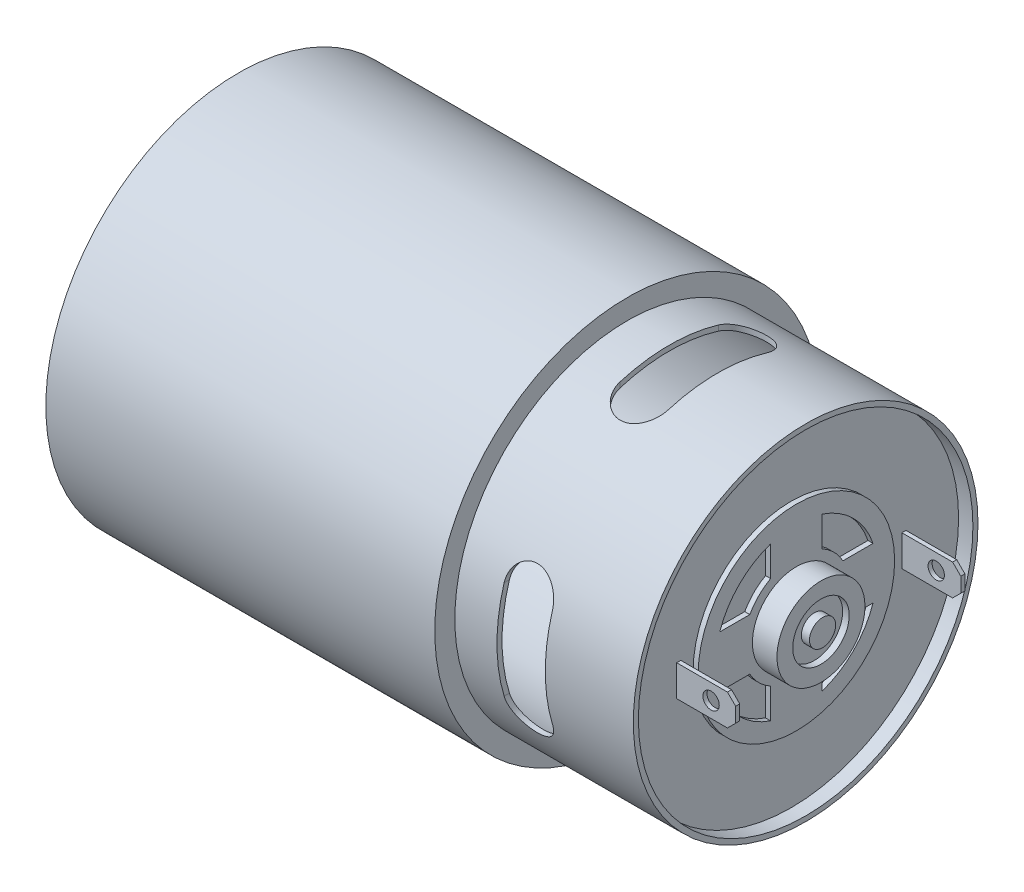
from build123d import *

# Parameters (mm, degrees)
EXTRUDE1_DEPTH           = 92.703985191
CIRPATTERN1_COUNT        = 4
EXTRUDE2_REACH           = 82.546
CIRPATTERN2_COUNT        = 4
EXTRUDE3_REACH           = 82.546
SKETCH4_R                = 1.25
EXTRUDE4_START           = -0.62
EXTRUDE4_DEPTH           = 0.62
CIRPATTERN3_COUNT        = 4
SKETCH6_W                = 7.2
SKETCH6_H                = 3.8
EXTRUDE7_DEPTH           = 0.5
EXTRUDE9_REACH           = 98.248
SKETCH7_R                = 1
CHAMFER1_SIZE            = 1
CHAMFER1_OF_MIRROR1_SIZE = 1
FILLET1_R                = 0.5


with BuildPart() as part:
    # Sketch1 → Revolve1 (revolve)
    with BuildSketch(Plane.XY, mode=Mode.PRIVATE) as revolve1_sk:
        with BuildLine():
            Line((-77.87, 6.5), (-77.87, 2.5))
            Line((-77.87, 2.5), (-82.97, 2.5))
            ThreePointArc((-82.97, 2.5), (-84.737766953, 1.767766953), (-85.47, 0))
            Line((-85.47, 0), (-72.75, 0))
            Line((-72.75, 0), (-72.75, 19.05))
            ThreePointArc((-72.75, 19.05), (-72.345807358, 20.025807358), (-71.37, 20.43))
            Line((-71.37, 20.43), (-4.44, 20.43))
            Line((-4.44, 20.43), (-4.44, 0))
            Line((-4.44, 0), (0, 0))
            Line((0, 0), (0, 1.6))
            Line((0, 1.6), (-1, 1.6))
            Line((-1, 1.6), (-1, 3.45))
            Line((-1, 3.45), (-0.2, 3.45))
            Line((-0.2, 3.45), (-0.2, 5.375))
            Line((-0.2, 5.375), (-3.2, 5.375))
            Line((-3.2, 5.375), (-3.2, 12))
            Line((-3.2, 12), (-3.82, 12))
            Line((-3.82, 12), (-3.82, 20.43))
            Line((-3.82, 20.43), (-2.07, 20.43))
            Line((-2.07, 20.43), (-2.07, 21.05))
            Line((-2.07, 21.05), (-23.87, 21.05))
            Line((-23.87, 21.05), (-23.87, 23.5))
            Line((-23.87, 23.5), (-71.37, 23.5))
            Line((-71.37, 23.5), (-71.37, 21.05))
            ThreePointArc((-71.37, 21.05), (-72.784213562, 20.464213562), (-73.37, 19.05))
            Line((-73.37, 19.05), (-73.37, 6.5))
            Line((-73.37, 6.5), (-77.87, 6.5))
        make_face()
    revolve(revolve1_sk.sketch.rotate(Axis((0, 0, 0), (-1, 0, 0)), 90), axis=Axis((0, 0, 0), (-1, 0, 0)))

    # Sketch2 → Extrude1 (cut, symmetric)
    with BuildSketch(Plane.XY):
        with BuildLine():
            Line((-18.72, 6), (-18.72, -6))
            ThreePointArc((-18.72, -6), (-15.77, -8.95), (-12.82, -6))
            Line((-12.82, -6), (-12.82, 6))
            ThreePointArc((-12.82, 6), (-15.77, 8.95), (-18.72, 6))
        make_face()
    extrude1 = extrude(amount=EXTRUDE1_DEPTH, both=True, mode=Mode.SUBTRACT)

    # CirPattern1: Extrude1 ×4 about axis
    cirpattern1_axis = Axis((0, 0, 0), (1, 0, 0))
    for i in range(1, CIRPATTERN1_COUNT):
        add(extrude1.rotate(cirpattern1_axis, i * 360 / CIRPATTERN1_COUNT), mode=Mode.SUBTRACT)

    # Sketch3 → Extrude2 (cut, up to next)
    with BuildSketch(Plane.ZY.offset(73.37), mode=Mode.PRIVATE) as extrude2_sk1:
        with BuildLine():
            Line((15.454813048, 4.141105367), (11.591109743, 3.105829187))
            ThreePointArc((11.591109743, 3.105829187), (8.485281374, 8.485281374), (3.105829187, 11.591109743))
            Line((3.105829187, 11.591109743), (4.141105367, 15.454813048))
            ThreePointArc((4.141105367, 15.454813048), (11.313708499, 11.313708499), (15.454813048, 4.141105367))
        make_face()
    extrude2_tool1 = extrude(extrude2_sk1.sketch, amount=-EXTRUDE2_REACH, mode=Mode.PRIVATE) & part.part
    extrude2 = extrude2_tool1.solids().sort_by_distance((-73.37, 9.51763, 9.51763))[0]
    add(extrude2, mode=Mode.SUBTRACT)

    # CirPattern2: Extrude2 ×4 about axis
    cirpattern2_axis = Axis((0, 0, 0), (1, 0, 0))
    for i in range(1, CIRPATTERN2_COUNT):
        add(extrude2.rotate(cirpattern2_axis, i * 360 / CIRPATTERN2_COUNT), mode=Mode.SUBTRACT)

    # Sketch4 → Extrude3 (cut, up to next)
    with BuildSketch(Plane.ZY.offset(73.37), mode=Mode.PRIVATE) as extrude3_sk1:
        with Locations((12.5, 0)):
            Circle(SKETCH4_R)
    extrude3_tool1 = extrude(extrude3_sk1.sketch, amount=-EXTRUDE3_REACH, mode=Mode.PRIVATE) & part.part
    # Sketch4 → Extrude3 (cut, up to next)
    with BuildSketch(Plane.ZY.offset(73.37), mode=Mode.PRIVATE) as extrude3_sk2:
        with Locations(Location((-12.5, 0, 0), (0, 0, 180))):
            Circle(SKETCH4_R)
    extrude3_tool2 = extrude(extrude3_sk2.sketch, amount=-EXTRUDE3_REACH, mode=Mode.PRIVATE) & part.part
    add(extrude3_tool1.solids().sort_by_distance((-73.37, 0, 12.5))[0], mode=Mode.SUBTRACT)
    add(extrude3_tool2.solids().sort_by_distance((-73.37, 0, -12.5))[0], mode=Mode.SUBTRACT)

    # Sketch5 → Extrude4 (cut)
    with BuildSketch(Plane(origin=(-3.2, 0, 0), x_dir=(0, 0, -1), z_dir=(1, 0, 0)).offset(EXTRUDE4_START)):
        with BuildLine():
            Line((9.359119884, 3.15), (5.685727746, 3.15))
            ThreePointArc((5.685727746, 3.15), (4.596194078, 4.596194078), (3.15, 5.685727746))
            Line((3.15, 5.685727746), (3.15, 9.359119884))
            ThreePointArc((3.15, 9.359119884), (6.982679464, 6.982679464), (9.359119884, 3.15))
        make_face()
    extrude4 = extrude(amount=EXTRUDE4_DEPTH, mode=Mode.SUBTRACT)

    # CirPattern3: Extrude4 ×4 about axis
    cirpattern3_axis = Axis((0, 0, 0), (1, 0, 0))
    for i in range(1, CIRPATTERN3_COUNT):
        add(extrude4.rotate(cirpattern3_axis, i * 360 / CIRPATTERN3_COUNT), mode=Mode.SUBTRACT)

    # Sketch6 → Extrude7 (add)
    with BuildSketch(Plane.XY.offset(14)):
        with Locations((-0.22, 0)):
            Rectangle(SKETCH6_W, SKETCH6_H)
    extrude7 = extrude(amount=-EXTRUDE7_DEPTH)

    # Sketch7 → Extrude9 (cut, up to next)
    with BuildSketch(Plane.XY.offset(14), mode=Mode.PRIVATE) as extrude9_sk1:
        with Locations((0.38, 0)):
            Circle(SKETCH7_R)
    extrude9_tool1 = extrude(extrude9_sk1.sketch, amount=-EXTRUDE9_REACH, mode=Mode.PRIVATE) & part.part
    extrude9 = extrude9_tool1.solids().sort_by_distance((0.38, 0, 14))[0]
    add(extrude9, mode=Mode.SUBTRACT)

    # Chamfer1
    chamfer1_edges = [part.edges().sort_by_distance(p)[0] for p in [
        (3.38, 1.9, 13.75),
        (3.38, -1.9, 13.75),
    ]]
    chamfer(chamfer1_edges, length=CHAMFER1_SIZE)

    # Mirror1: Extrude7, Extrude9 across plane
    add(extrude7.mirror(Plane.XY))
    add(extrude9.mirror(Plane.XY), mode=Mode.SUBTRACT)

    # Chamfer1 of Mirror1
    chamfer1_of_mirror1_edges = [part.edges().sort_by_distance(p)[0] for p in [
        (3.38, 1.9, -13.75),
        (3.38, -1.9, -13.75),
    ]]
    chamfer(chamfer1_of_mirror1_edges, length=CHAMFER1_OF_MIRROR1_SIZE)

    # Fillet1
    fillet1_edges = [part.edges().sort_by_distance(p)[0] for p in [
        (-77.87, 0, 6.5),
        (-73.37, 0, 6.5),
    ]]
    fillet(fillet1_edges, radius=FILLET1_R)


solid = part.part
